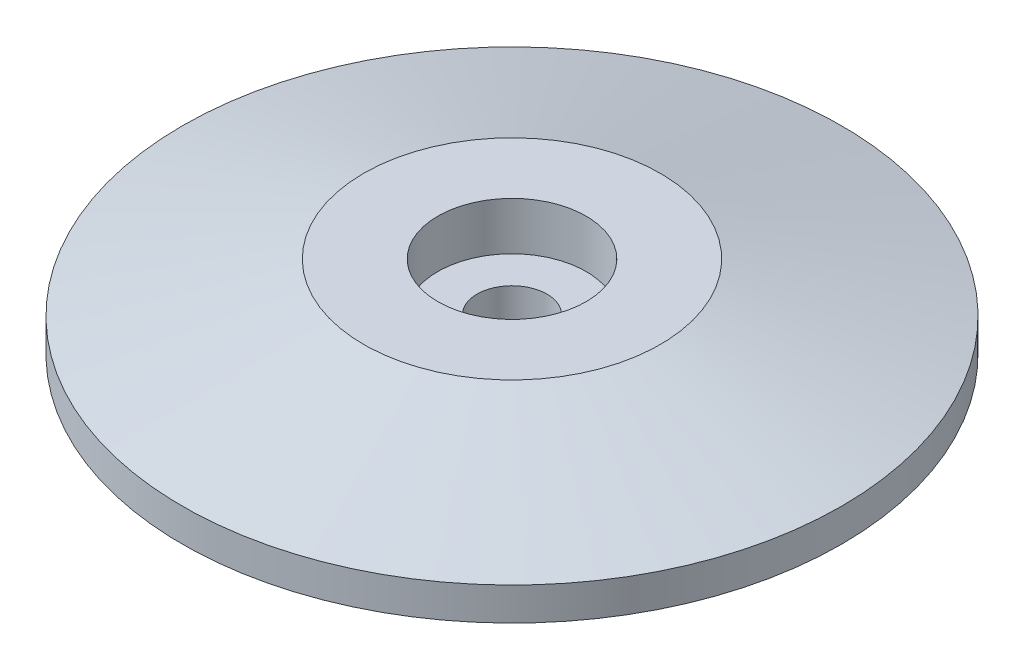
from build123d import *

# Parameters (mm, degrees)
SKETCH2_W                                = 4.7625
SKETCH2_H                                = 3.175
CBORE_FOR_1_2_HEX_HEAD_BOLT1_D           = 13.49248
CBORE_FOR_1_2_HEX_HEAD_BOLT1_CBORE_D     = 28.575
CBORE_FOR_1_2_HEX_HEAD_BOLT1_CBORE_DEPTH = 9.2456


with BuildPart() as part:
    # Sketch1 → Base-Revolve (revolve)
    with BuildSketch(Plane.XY, mode=Mode.PRIVATE) as base_revolve_sk:
        Polygon((0, 0), (63.5, 0), (63.5, 6.35), (28.575, 15.875), (0, 15.875), align=None)
    revolve(base_revolve_sk.sketch.rotate(Axis((0, 15.875, 0), (0, -1, 0)), 180), axis=Axis((0, 15.875, 0), (0, -1, 0)))

    # Sketch2 → Groove (revolve, cut)
    with BuildSketch(Plane.XY, mode=Mode.PRIVATE) as groove_sk:
        with Locations((29.36875, 1.5875)):
            Rectangle(SKETCH2_W, SKETCH2_H)
    revolve(groove_sk.sketch.rotate(Axis((0, 0, 0), (0, 1, 0)), 90), axis=Axis((0, 0, 0), (0, 1, 0)), mode=Mode.SUBTRACT)

    # CBORE for 1_2 Hex Head Bolt1 (through all)
    with Locations(Plane(origin=(0, 15.875, 0), x_dir=(-1, 0, 0), z_dir=(0, 1, 0))):
        with Locations((0, 0)):
            CounterBoreHole(CBORE_FOR_1_2_HEX_HEAD_BOLT1_D / 2, CBORE_FOR_1_2_HEX_HEAD_BOLT1_CBORE_D / 2, CBORE_FOR_1_2_HEX_HEAD_BOLT1_CBORE_DEPTH)


solid = part.part
